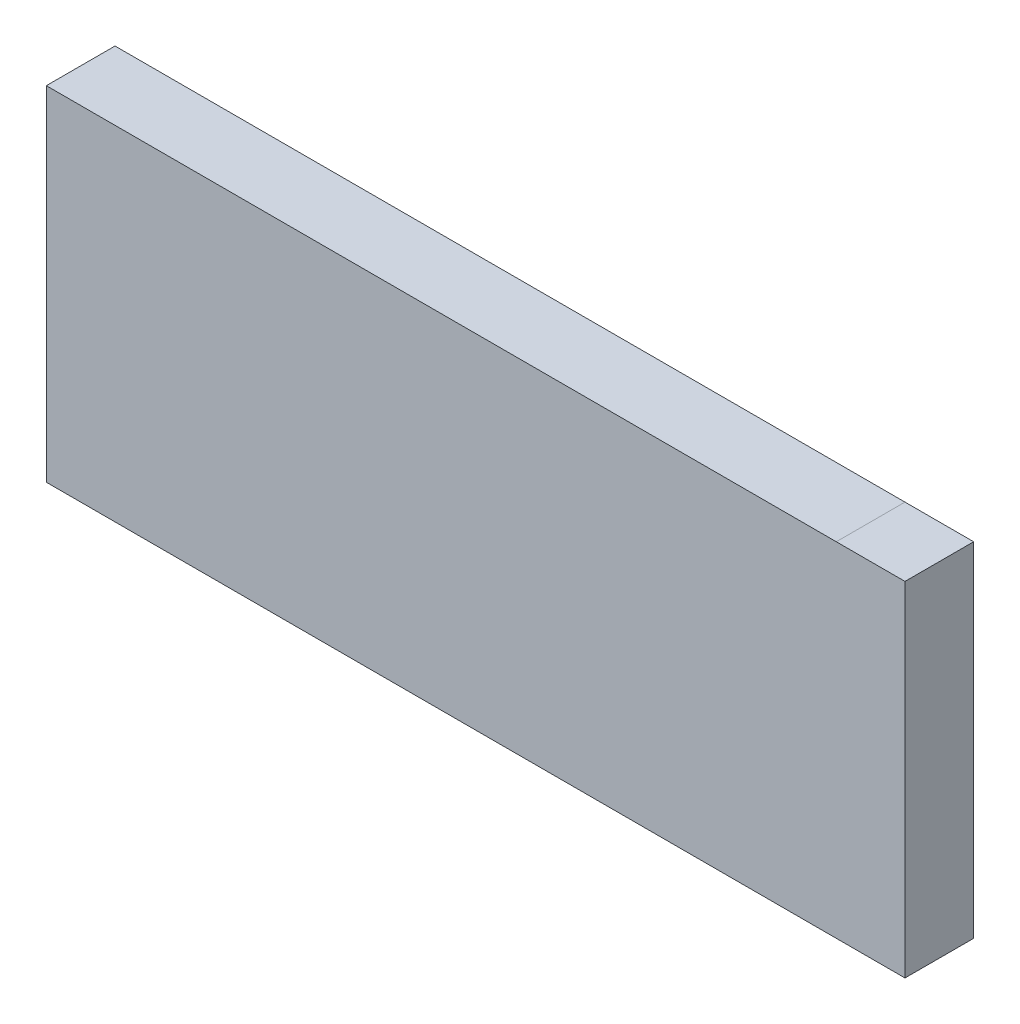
ISO-10303-21;
HEADER;
FILE_DESCRIPTION(('STEP AP214'),'2;1');
FILE_NAME('part.step','',(''),(''),'','','');
FILE_SCHEMA(('AUTOMOTIVE_DESIGN { 1 0 10303 214 1 1 1 1 }'));
ENDSEC;
DATA;
#1=APPLICATION_CONTEXT('core data for automotive mechanical design processes');
#2=APPLICATION_PROTOCOL_DEFINITION('international standard','automotive_design',2000,#1);
#3=PRODUCT_CONTEXT('',#1,'mechanical');
#4=PRODUCT('Part','Part','',(#3));
#5=PRODUCT_RELATED_PRODUCT_CATEGORY('part','',(#4));
#6=PRODUCT_DEFINITION_FORMATION('','',#4);
#7=PRODUCT_DEFINITION_CONTEXT('part definition',#1,'design');
#8=PRODUCT_DEFINITION('design','',#6,#7);
#9=PRODUCT_DEFINITION_SHAPE('','',#8);
#10=(LENGTH_UNIT() NAMED_UNIT(*) SI_UNIT(.MILLI.,.METRE.));
#11=(NAMED_UNIT(*) PLANE_ANGLE_UNIT() SI_UNIT($,.RADIAN.));
#12=(NAMED_UNIT(*) SI_UNIT($,.STERADIAN.) SOLID_ANGLE_UNIT());
#13=UNCERTAINTY_MEASURE_WITH_UNIT(LENGTH_MEASURE(1.E-05),#10,'distance_accuracy_value','');
#14=(GEOMETRIC_REPRESENTATION_CONTEXT(3) GLOBAL_UNCERTAINTY_ASSIGNED_CONTEXT((#13)) GLOBAL_UNIT_ASSIGNED_CONTEXT((#10,
#11,#12)) REPRESENTATION_CONTEXT('',''));
#15=CARTESIAN_POINT('',(0.,0.,0.));
#16=DIRECTION('',(0.,0.,1.));
#17=DIRECTION('',(1.,0.,0.));
#18=AXIS2_PLACEMENT_3D('',#15,#16,#17);
#19=CARTESIAN_POINT('',(0.,50.,20.));
#20=DIRECTION('',(0.,-1.,0.));
#21=DIRECTION('',(0.,0.,-1.));
#22=AXIS2_PLACEMENT_3D('',#19,#20,#21);
#23=PLANE('',#22);
#24=DIRECTION('',(0.,0.,-1.));
#25=VECTOR('',#24,1.);
#26=CARTESIAN_POINT('',(230.,50.,20.));
#27=LINE('',#26,#25);
#28=CARTESIAN_POINT('',(230.,50.,20.));
#29=VERTEX_POINT('',#28);
#30=CARTESIAN_POINT('',(230.,50.,0.));
#31=VERTEX_POINT('',#30);
#32=EDGE_CURVE('E11',#29,#31,#27,.T.);
#33=ORIENTED_EDGE('',*,*,#32,.F.);
#34=DIRECTION('',(-1.,0.,0.));
#35=VECTOR('',#34,1.);
#36=CARTESIAN_POINT('',(0.,50.,20.));
#37=LINE('',#36,#35);
#38=CARTESIAN_POINT('',(250.,50.,20.));
#39=VERTEX_POINT('',#38);
#40=EDGE_CURVE('E119',#39,#29,#37,.T.);
#41=ORIENTED_EDGE('',*,*,#40,.F.);
#42=DIRECTION('',(0.,0.,-1.));
#43=VECTOR('',#42,1.);
#44=CARTESIAN_POINT('',(250.,50.,20.));
#45=LINE('',#44,#43);
#46=CARTESIAN_POINT('',(250.,50.,0.));
#47=VERTEX_POINT('',#46);
#48=EDGE_CURVE('E87',#39,#47,#45,.T.);
#49=ORIENTED_EDGE('',*,*,#48,.T.);
#50=DIRECTION('',(-1.,0.,0.));
#51=VECTOR('',#50,1.);
#52=CARTESIAN_POINT('',(0.,50.,0.));
#53=LINE('',#52,#51);
#54=EDGE_CURVE('E112',#47,#31,#53,.T.);
#55=ORIENTED_EDGE('',*,*,#54,.T.);
#56=EDGE_LOOP('',(#33,#41,#49,#55));
#57=FACE_BOUND('',#56,.T.);
#58=ADVANCED_FACE('F36',(#57),#23,.F.);
#59=CARTESIAN_POINT('',(250.,-50.,20.));
#60=DIRECTION('',(0.,1.,0.));
#61=DIRECTION('',(0.,0.,1.));
#62=AXIS2_PLACEMENT_3D('',#59,#60,#61);
#63=PLANE('',#62);
#64=DIRECTION('',(1.,0.,0.));
#65=VECTOR('',#64,1.);
#66=CARTESIAN_POINT('',(250.,-50.,0.));
#67=LINE('',#66,#65);
#68=CARTESIAN_POINT('',(0.,-50.,0.));
#69=VERTEX_POINT('',#68);
#70=CARTESIAN_POINT('',(250.,-50.,0.));
#71=VERTEX_POINT('',#70);
#72=EDGE_CURVE('E103',#69,#71,#67,.T.);
#73=ORIENTED_EDGE('',*,*,#72,.T.);
#74=DIRECTION('',(0.,0.,-1.));
#75=VECTOR('',#74,1.);
#76=CARTESIAN_POINT('',(250.,-50.,20.));
#77=LINE('',#76,#75);
#78=CARTESIAN_POINT('',(250.,-50.,20.));
#79=VERTEX_POINT('',#78);
#80=EDGE_CURVE('E45',#79,#71,#77,.T.);
#81=ORIENTED_EDGE('',*,*,#80,.F.);
#82=DIRECTION('',(1.,0.,0.));
#83=VECTOR('',#82,1.);
#84=CARTESIAN_POINT('',(250.,-50.,20.));
#85=LINE('',#84,#83);
#86=CARTESIAN_POINT('',(0.,-50.,20.));
#87=VERTEX_POINT('',#86);
#88=EDGE_CURVE('E91',#87,#79,#85,.T.);
#89=ORIENTED_EDGE('',*,*,#88,.F.);
#90=DIRECTION('',(0.,0.,-1.));
#91=VECTOR('',#90,1.);
#92=CARTESIAN_POINT('',(0.,-50.,20.));
#93=LINE('',#92,#91);
#94=EDGE_CURVE('E109',#87,#69,#93,.T.);
#95=ORIENTED_EDGE('',*,*,#94,.T.);
#96=EDGE_LOOP('',(#73,#81,#89,#95));
#97=FACE_BOUND('',#96,.T.);
#98=ADVANCED_FACE('F38',(#97),#63,.F.);
#99=CARTESIAN_POINT('',(250.,50.,20.));
#100=DIRECTION('',(-1.,0.,0.));
#101=DIRECTION('',(0.,0.,1.));
#102=AXIS2_PLACEMENT_3D('',#99,#100,#101);
#103=PLANE('',#102);
#104=DIRECTION('',(0.,1.,0.));
#105=VECTOR('',#104,1.);
#106=CARTESIAN_POINT('',(250.,50.,0.));
#107=LINE('',#106,#105);
#108=EDGE_CURVE('E115',#71,#47,#107,.T.);
#109=ORIENTED_EDGE('',*,*,#108,.T.);
#110=ORIENTED_EDGE('',*,*,#48,.F.);
#111=DIRECTION('',(0.,1.,0.));
#112=VECTOR('',#111,1.);
#113=CARTESIAN_POINT('',(250.,50.,20.));
#114=LINE('',#113,#112);
#115=EDGE_CURVE('E81',#79,#39,#114,.T.);
#116=ORIENTED_EDGE('',*,*,#115,.F.);
#117=ORIENTED_EDGE('',*,*,#80,.T.);
#118=EDGE_LOOP('',(#109,#110,#116,#117));
#119=FACE_BOUND('',#118,.T.);
#120=ADVANCED_FACE('F83',(#119),#103,.F.);
#121=CARTESIAN_POINT('',(0.,50.,20.));
#122=VERTEX_POINT('',#121);
#123=EDGE_CURVE('E90',#29,#122,#37,.T.);
#124=ORIENTED_EDGE('',*,*,#123,.F.);
#125=ORIENTED_EDGE('',*,*,#32,.T.);
#126=CARTESIAN_POINT('',(0.,50.,0.));
#127=VERTEX_POINT('',#126);
#128=EDGE_CURVE('E114',#31,#127,#53,.T.);
#129=ORIENTED_EDGE('',*,*,#128,.T.);
#130=DIRECTION('',(0.,0.,-1.));
#131=VECTOR('',#130,1.);
#132=CARTESIAN_POINT('',(0.,50.,20.));
#133=LINE('',#132,#131);
#134=EDGE_CURVE('E104',#122,#127,#133,.T.);
#135=ORIENTED_EDGE('',*,*,#134,.F.);
#136=EDGE_LOOP('',(#124,#125,#129,#135));
#137=FACE_BOUND('',#136,.T.);
#138=ADVANCED_FACE('F121',(#137),#23,.F.);
#139=CARTESIAN_POINT('',(0.,-50.,20.));
#140=DIRECTION('',(1.,0.,0.));
#141=DIRECTION('',(0.,0.,-1.));
#142=AXIS2_PLACEMENT_3D('',#139,#140,#141);
#143=PLANE('',#142);
#144=DIRECTION('',(0.,-1.,0.));
#145=VECTOR('',#144,1.);
#146=CARTESIAN_POINT('',(0.,-50.,0.));
#147=LINE('',#146,#145);
#148=EDGE_CURVE('E100',#127,#69,#147,.T.);
#149=ORIENTED_EDGE('',*,*,#148,.T.);
#150=ORIENTED_EDGE('',*,*,#94,.F.);
#151=DIRECTION('',(0.,-1.,0.));
#152=VECTOR('',#151,1.);
#153=CARTESIAN_POINT('',(0.,-50.,20.));
#154=LINE('',#153,#152);
#155=EDGE_CURVE('E96',#122,#87,#154,.T.);
#156=ORIENTED_EDGE('',*,*,#155,.F.);
#157=ORIENTED_EDGE('',*,*,#134,.T.);
#158=EDGE_LOOP('',(#149,#150,#156,#157));
#159=FACE_BOUND('',#158,.T.);
#160=ADVANCED_FACE('F124',(#159),#143,.F.);
#161=CARTESIAN_POINT('',(0.,0.,20.));
#162=DIRECTION('',(0.,0.,-1.));
#163=DIRECTION('',(-1.,0.,0.));
#164=AXIS2_PLACEMENT_3D('',#161,#162,#163);
#165=PLANE('',#164);
#166=ORIENTED_EDGE('',*,*,#88,.T.);
#167=ORIENTED_EDGE('',*,*,#115,.T.);
#168=ORIENTED_EDGE('',*,*,#40,.T.);
#169=ORIENTED_EDGE('',*,*,#123,.T.);
#170=ORIENTED_EDGE('',*,*,#155,.T.);
#171=EDGE_LOOP('',(#166,#167,#168,#169,#170));
#172=FACE_BOUND('',#171,.T.);
#173=ADVANCED_FACE('F94',(#172),#165,.F.);
#174=CARTESIAN_POINT('',(0.,0.,0.));
#175=DIRECTION('',(0.,0.,-1.));
#176=DIRECTION('',(-1.,0.,0.));
#177=AXIS2_PLACEMENT_3D('',#174,#175,#176);
#178=PLANE('',#177);
#179=ORIENTED_EDGE('',*,*,#72,.F.);
#180=ORIENTED_EDGE('',*,*,#148,.F.);
#181=ORIENTED_EDGE('',*,*,#128,.F.);
#182=ORIENTED_EDGE('',*,*,#54,.F.);
#183=ORIENTED_EDGE('',*,*,#108,.F.);
#184=EDGE_LOOP('',(#179,#180,#181,#182,#183));
#185=FACE_BOUND('',#184,.T.);
#186=ADVANCED_FACE('F126',(#185),#178,.T.);
#187=CLOSED_SHELL('',(#58,#98,#120,#138,#160,#173,#186));
#188=MANIFOLD_SOLID_BREP('B2',#187);
#189=ADVANCED_BREP_SHAPE_REPRESENTATION('',(#18,#188),#14);
#190=SHAPE_DEFINITION_REPRESENTATION(#9,#189);
ENDSEC;
END-ISO-10303-21;
